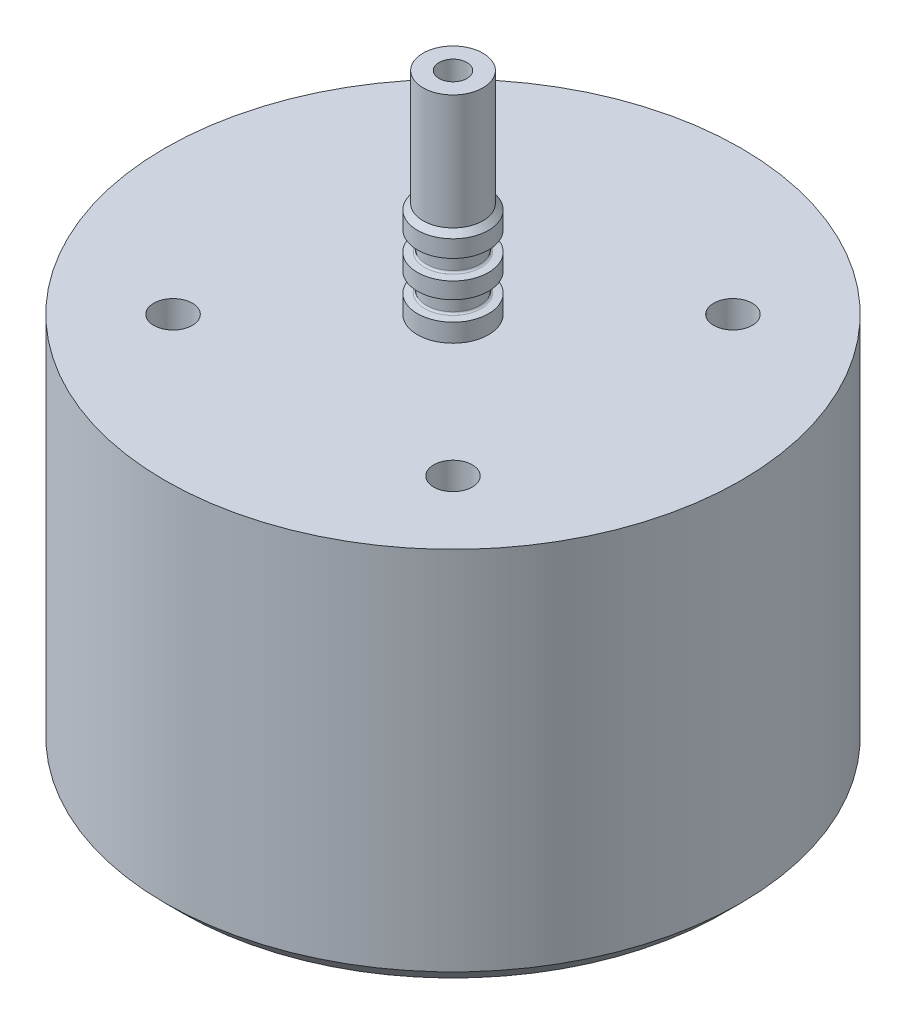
from build123d import *

# Parameters (mm, degrees)
BOSS_EXTRUDE2_START = 0.01016
SKETCH2_R           = 38.1
BOSS_EXTRUDE2_DEPTH = 50.8
CHAMFER2_SIZE       = 2.38125
CIRPATTERN1_COUNT   = 4
FILLET1_R           = 0.254


with BuildPart() as part:
    # Sketch2 → Boss-Extrude2 (new body)
    with BuildSketch(Plane.XZ.offset(BOSS_EXTRUDE2_START)):
        with Locations(Location((0, 0, 0), (0, 0, 270))):
            Circle(SKETCH2_R)
    extrude(amount=BOSS_EXTRUDE2_DEPTH)

    # Chamfer2
    chamfer2_edges = [part.edges().sort_by_distance(p)[0] for p in [
        (0, -50.81016, 38.1),
    ]]
    chamfer(chamfer2_edges, length=CHAMFER2_SIZE)

    # Sketch3 → 1_4-20 Tapped Hole1 (revolve, cut)
    with BuildSketch(Plane(origin=(-18.52177825, -0.01016, -18.52177825), x_dir=(0, 0, 1), z_dir=(1, 0, 0))):
        Polygon((0, 0), (0, 14.868816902), (2.5527, 13.335), (2.5527, 0), align=None)
    f_1_4_20_tapped_hole1 = revolve(axis=Axis((-18.52177825, 6.33984, -18.52177825), (0, -1, 0)), mode=Mode.SUBTRACT)

    # CirPattern1: 1_4-20 Tapped Hole1 ×4 about axis
    cirpattern1_axis = Axis((0, 0, 0), (0, 1, 0))
    for i in range(1, CIRPATTERN1_COUNT):
        add(f_1_4_20_tapped_hole1.rotate(cirpattern1_axis, i * 360 / CIRPATTERN1_COUNT), mode=Mode.SUBTRACT)


with BuildPart() as body_2:
    # Sketch6 → Revolve1 (revolve)
    with BuildSketch(Plane.XY, mode=Mode.PRIVATE) as revolve1_sk:
        Polygon((4.699, -0.01016), (4.699, 11.95959), (3.96875, 12.68984), (3.96875, 27.92984), (1.8415, 27.92984), (1.8415, -0.002862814), align=None)
    revolve(revolve1_sk.sketch.rotate(Axis((0, 0, 0), (0, 1, 0)), 90), axis=Axis((0, 0, 0), (0, 1, 0)))

    # Sketch8 → 2-010 Cut-Revolve1 (revolve, cut)
    with BuildSketch(Plane.XY, mode=Mode.PRIVATE) as f_2_010_cut_revolve1_sk:
        Polygon((4.699, 9.702945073), (3.4925, 9.59739), (3.4925, 7.23519), (4.699, 7.129634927), align=None)
        Polygon((4.699, 4.978545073), (3.4925, 4.87299), (3.4925, 2.51079), (4.699, 2.405234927), align=None)
    revolve(f_2_010_cut_revolve1_sk.sketch.rotate(Axis((0, 0, 0), (0, 1, 0)), 90), axis=Axis((0, 0, 0), (0, 1, 0)), mode=Mode.SUBTRACT)

    # Fillet1
    fillet1_edges = [body_2.edges().sort_by_distance(p)[0] for p in [
        (0, 9.59739, 3.4925),
        (0, 7.23519, 3.4925),
        (0, 4.87299, 3.4925),
        (0, 2.51079, 3.4925),
    ]]
    fillet(fillet1_edges, radius=FILLET1_R)


solid = Compound([part.part, body_2.part])
